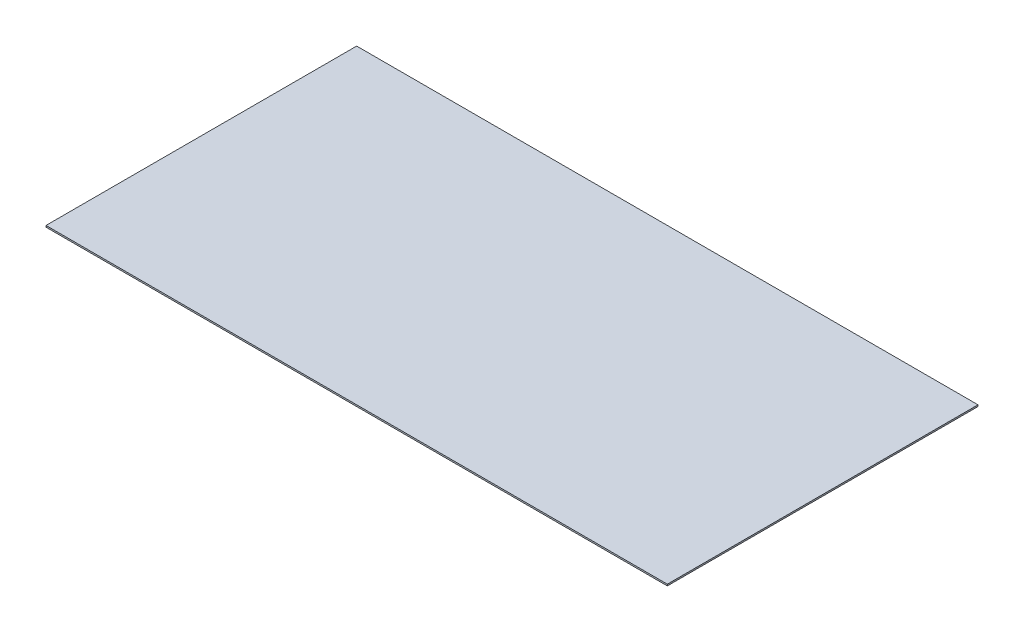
from build123d import *

# Parameters (mm, degrees)
CROQUIS1_W              = 6000
CROQUIS1_H              = 3000
SALIENTE_EXTRUIR1_DEPTH = 15


with BuildPart() as part:
    # Croquis1 → Saliente-Extruir1 (new body)
    with BuildSketch(Plane(origin=(0, 0, 0), x_dir=(1, 0, 0), z_dir=(0, 1, 0))):
        with Locations((1390.046040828, 467.159478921)):
            Rectangle(CROQUIS1_W, CROQUIS1_H)
    extrude(amount=SALIENTE_EXTRUIR1_DEPTH)


solid = part.part
